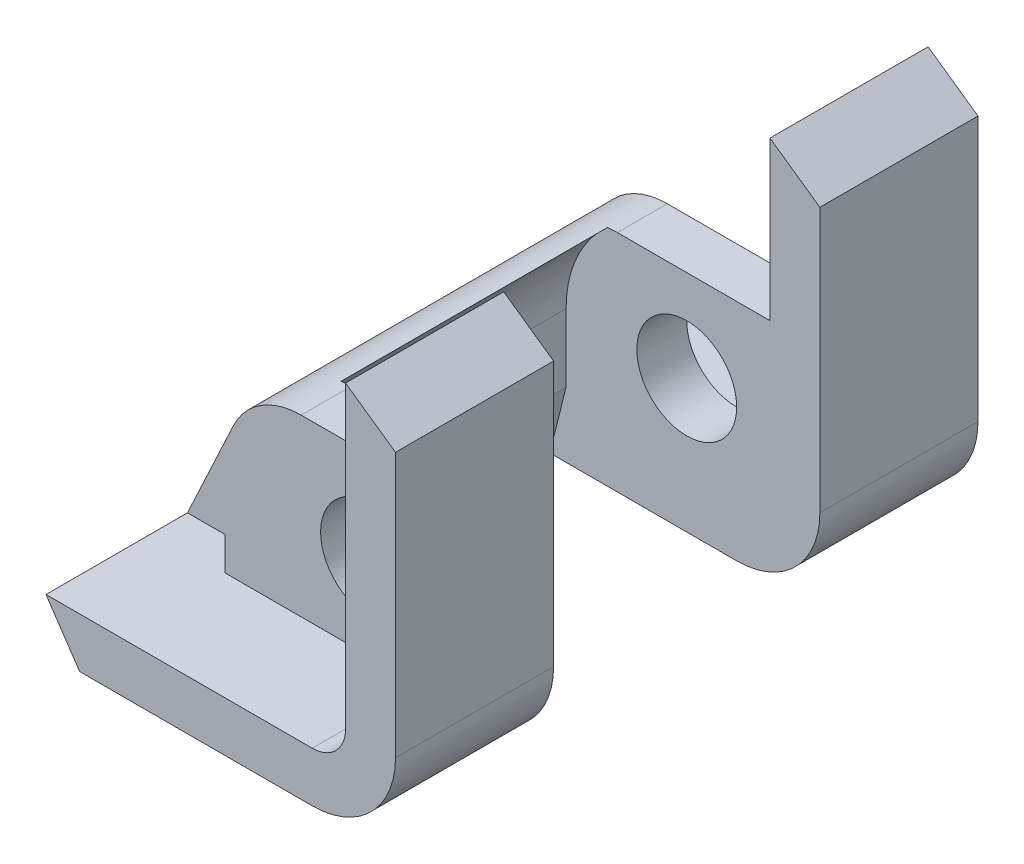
ISO-10303-21;
HEADER;
FILE_DESCRIPTION(('STEP AP214'),'2;1');
FILE_NAME('part.step','',(''),(''),'','','');
FILE_SCHEMA(('AUTOMOTIVE_DESIGN { 1 0 10303 214 1 1 1 1 }'));
ENDSEC;
DATA;
#1=APPLICATION_CONTEXT('core data for automotive mechanical design processes');
#2=APPLICATION_PROTOCOL_DEFINITION('international standard','automotive_design',2000,#1);
#3=PRODUCT_CONTEXT('',#1,'mechanical');
#4=PRODUCT('Part','Part','',(#3));
#5=PRODUCT_RELATED_PRODUCT_CATEGORY('part','',(#4));
#6=PRODUCT_DEFINITION_FORMATION('','',#4);
#7=PRODUCT_DEFINITION_CONTEXT('part definition',#1,'design');
#8=PRODUCT_DEFINITION('design','',#6,#7);
#9=PRODUCT_DEFINITION_SHAPE('','',#8);
#10=(LENGTH_UNIT() NAMED_UNIT(*) SI_UNIT(.MILLI.,.METRE.));
#11=(NAMED_UNIT(*) PLANE_ANGLE_UNIT() SI_UNIT($,.RADIAN.));
#12=(NAMED_UNIT(*) SI_UNIT($,.STERADIAN.) SOLID_ANGLE_UNIT());
#13=UNCERTAINTY_MEASURE_WITH_UNIT(LENGTH_MEASURE(1.E-05),#10,'distance_accuracy_value','');
#14=(GEOMETRIC_REPRESENTATION_CONTEXT(3) GLOBAL_UNCERTAINTY_ASSIGNED_CONTEXT((#13)) GLOBAL_UNIT_ASSIGNED_CONTEXT((#10,
#11,#12)) REPRESENTATION_CONTEXT('',''));
#15=CARTESIAN_POINT('',(0.,0.,0.));
#16=DIRECTION('',(0.,0.,1.));
#17=DIRECTION('',(1.,0.,0.));
#18=AXIS2_PLACEMENT_3D('',#15,#16,#17);
#19=CARTESIAN_POINT('',(-7.623976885,-21.54910891,-11.));
#20=DIRECTION('',(-0.906307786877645,0.422618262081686,0.));
#21=DIRECTION('',(-0.422618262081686,-0.906307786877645,0.));
#22=AXIS2_PLACEMENT_3D('',#19,#20,#21);
#23=PLANE('',#22);
#24=DIRECTION('',(-0.422618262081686,-0.906307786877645,0.));
#25=VECTOR('',#24,1.);
#26=CARTESIAN_POINT('',(-6.24795377,-18.59821782,-11.));
#27=LINE('',#26,#25);
#28=CARTESIAN_POINT('',(-6.24795376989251,-18.5982178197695,-11.));
#29=VERTEX_POINT('',#28);
#30=CARTESIAN_POINT('',(-9.,-24.5,-11.));
#31=VERTEX_POINT('',#30);
#32=EDGE_CURVE('E165',#29,#31,#27,.T.);
#33=ORIENTED_EDGE('',*,*,#32,.T.);
#34=DIRECTION('',(0.,0.,-1.));
#35=VECTOR('',#34,1.);
#36=CARTESIAN_POINT('',(-9.,-24.5,-11.));
#37=LINE('',#36,#35);
#38=CARTESIAN_POINT('',(-9.,-24.5,11.));
#39=VERTEX_POINT('',#38);
#40=EDGE_CURVE('E168',#39,#31,#37,.T.);
#41=ORIENTED_EDGE('',*,*,#40,.F.);
#42=DIRECTION('',(-0.422618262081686,-0.906307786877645,0.));
#43=VECTOR('',#42,1.);
#44=CARTESIAN_POINT('',(-6.24795377,-18.59821782,11.));
#45=LINE('',#44,#43);
#46=CARTESIAN_POINT('',(-6.24795376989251,-18.5982178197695,11.));
#47=VERTEX_POINT('',#46);
#48=EDGE_CURVE('E205',#47,#39,#45,.T.);
#49=ORIENTED_EDGE('',*,*,#48,.F.);
#50=DIRECTION('',(0.,0.,1.));
#51=VECTOR('',#50,1.);
#52=CARTESIAN_POINT('',(-6.24795376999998,-18.59821782,-11.));
#53=LINE('',#52,#51);
#54=EDGE_CURVE('E170',#29,#47,#53,.T.);
#55=ORIENTED_EDGE('',*,*,#54,.F.);
#56=EDGE_LOOP('',(#33,#41,#49,#55));
#57=FACE_BOUND('',#56,.T.);
#58=ADVANCED_FACE('F16',(#57),#23,.T.);
#59=CARTESIAN_POINT('',(-7.875,-24.5,-11.));
#60=DIRECTION('',(0.,-1.,0.));
#61=DIRECTION('',(0.,0.,-1.));
#62=AXIS2_PLACEMENT_3D('',#59,#60,#61);
#63=PLANE('',#62);
#64=DIRECTION('',(1.,0.,0.));
#65=VECTOR('',#64,1.);
#66=CARTESIAN_POINT('',(-0.258475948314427,-24.5,-11.));
#67=LINE('',#66,#65);
#68=CARTESIAN_POINT('',(-6.75,-24.5,-11.));
#69=VERTEX_POINT('',#68);
#70=EDGE_CURVE('E174',#31,#69,#67,.T.);
#71=ORIENTED_EDGE('',*,*,#70,.T.);
#72=DIRECTION('',(0.,0.,1.));
#73=VECTOR('',#72,1.);
#74=CARTESIAN_POINT('',(-6.75,-24.5,-11.));
#75=LINE('',#74,#73);
#76=CARTESIAN_POINT('',(-6.75,-24.5,11.));
#77=VERTEX_POINT('',#76);
#78=EDGE_CURVE('E266',#77,#69,#75,.F.);
#79=ORIENTED_EDGE('',*,*,#78,.F.);
#80=DIRECTION('',(1.,0.,0.));
#81=VECTOR('',#80,1.);
#82=CARTESIAN_POINT('',(-0.258475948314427,-24.5,11.));
#83=LINE('',#82,#81);
#84=EDGE_CURVE('E181',#39,#77,#83,.T.);
#85=ORIENTED_EDGE('',*,*,#84,.F.);
#86=ORIENTED_EDGE('',*,*,#40,.T.);
#87=EDGE_LOOP('',(#71,#79,#85,#86));
#88=FACE_BOUND('',#87,.T.);
#89=ADVANCED_FACE('F178',(#88),#63,.T.);
#90=CARTESIAN_POINT('',(-2.169568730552,-20.4999999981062,-11.));
#91=DIRECTION('',(0.,0.,1.));
#92=DIRECTION('',(1.,0.,0.));
#93=AXIS2_PLACEMENT_3D('',#90,#91,#92);
#94=CYLINDRICAL_SURFACE('',#93,4.49999999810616);
#95=CARTESIAN_POINT('',(-2.169568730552,-20.4999999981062,11.));
#96=DIRECTION('',(0.,0.,1.));
#97=DIRECTION('',(1.,0.,0.));
#98=AXIS2_PLACEMENT_3D('',#95,#96,#97);
#99=CIRCLE('',#98,4.49999999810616);
#100=CARTESIAN_POINT('',(-2.169568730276,-16.,11.));
#101=VERTEX_POINT('',#100);
#102=EDGE_CURVE('E201',#101,#47,#99,.T.);
#103=ORIENTED_EDGE('',*,*,#102,.F.);
#104=DIRECTION('',(0.,0.,1.));
#105=VECTOR('',#104,1.);
#106=CARTESIAN_POINT('',(-2.16956873,-16.,-11.));
#107=LINE('',#106,#105);
#108=CARTESIAN_POINT('',(-2.169568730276,-16.,8.));
#109=VERTEX_POINT('',#108);
#110=EDGE_CURVE('E260',#109,#101,#107,.T.);
#111=ORIENTED_EDGE('',*,*,#110,.F.);
#112=CARTESIAN_POINT('',(-2.169568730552,-20.4999999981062,8.));
#113=DIRECTION('',(0.,0.,1.));
#114=DIRECTION('',(1.,0.,0.));
#115=AXIS2_PLACEMENT_3D('',#112,#113,#114);
#116=CIRCLE('',#115,4.49999999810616);
#117=CARTESIAN_POINT('',(-2.77007343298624,-16.040247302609,8.));
#118=VERTEX_POINT('',#117);
#119=EDGE_CURVE('E19',#109,#118,#116,.T.);
#120=ORIENTED_EDGE('',*,*,#119,.T.);
#121=DIRECTION('',(0.,0.,1.));
#122=VECTOR('',#121,1.);
#123=CARTESIAN_POINT('',(-2.77007343,-16.0402473,-8.));
#124=LINE('',#123,#122);
#125=CARTESIAN_POINT('',(-2.77007343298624,-16.040247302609,-8.));
#126=VERTEX_POINT('',#125);
#127=EDGE_CURVE('E274',#118,#126,#124,.F.);
#128=ORIENTED_EDGE('',*,*,#127,.T.);
#129=CARTESIAN_POINT('',(-2.169568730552,-20.4999999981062,-8.));
#130=DIRECTION('',(0.,0.,1.));
#131=DIRECTION('',(1.,0.,0.));
#132=AXIS2_PLACEMENT_3D('',#129,#130,#131);
#133=CIRCLE('',#132,4.49999999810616);
#134=CARTESIAN_POINT('',(-2.169568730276,-16.,-8.));
#135=VERTEX_POINT('',#134);
#136=EDGE_CURVE('E202',#126,#135,#133,.F.);
#137=ORIENTED_EDGE('',*,*,#136,.T.);
#138=DIRECTION('',(0.,0.,1.));
#139=VECTOR('',#138,1.);
#140=CARTESIAN_POINT('',(-2.16956873,-16.,-11.));
#141=LINE('',#140,#139);
#142=CARTESIAN_POINT('',(-2.169568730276,-16.,-11.));
#143=VERTEX_POINT('',#142);
#144=EDGE_CURVE('E261',#143,#135,#141,.T.);
#145=ORIENTED_EDGE('',*,*,#144,.F.);
#146=CARTESIAN_POINT('',(-2.169568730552,-20.4999999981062,-11.));
#147=DIRECTION('',(0.,0.,1.));
#148=DIRECTION('',(1.,0.,0.));
#149=AXIS2_PLACEMENT_3D('',#146,#147,#148);
#150=CIRCLE('',#149,4.49999999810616);
#151=EDGE_CURVE('E175',#143,#29,#150,.T.);
#152=ORIENTED_EDGE('',*,*,#151,.T.);
#153=ORIENTED_EDGE('',*,*,#54,.T.);
#154=EDGE_LOOP('',(#103,#111,#120,#128,#137,#145,#152,#153));
#155=FACE_BOUND('',#154,.T.);
#156=ADVANCED_FACE('F273',(#155),#94,.T.);
#157=CARTESIAN_POINT('',(-0.258475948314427,-21.5587344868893,11.));
#158=DIRECTION('',(0.,0.,1.));
#159=DIRECTION('',(1.,0.,0.));
#160=AXIS2_PLACEMENT_3D('',#157,#158,#159);
#161=PLANE('',#160);
#162=DIRECTION('',(0.,1.,0.));
#163=VECTOR('',#162,1.);
#164=CARTESIAN_POINT('',(-6.75,-25.5,11.));
#165=LINE('',#164,#163);
#166=CARTESIAN_POINT('',(-6.75,-26.5,11.));
#167=VERTEX_POINT('',#166);
#168=EDGE_CURVE('E204',#167,#77,#165,.T.);
#169=ORIENTED_EDGE('',*,*,#168,.F.);
#170=DIRECTION('',(1.,0.,0.));
#171=VECTOR('',#170,1.);
#172=CARTESIAN_POINT('',(-3.,-26.5,11.));
#173=LINE('',#172,#171);
#174=CARTESIAN_POINT('',(5.,-26.5,11.));
#175=VERTEX_POINT('',#174);
#176=EDGE_CURVE('E251',#175,#167,#173,.F.);
#177=ORIENTED_EDGE('',*,*,#176,.F.);
#178=CARTESIAN_POINT('',(5.,-24.5,11.));
#179=DIRECTION('',(0.,0.,1.));
#180=DIRECTION('',(1.,0.,0.));
#181=AXIS2_PLACEMENT_3D('',#178,#179,#180);
#182=CIRCLE('',#181,2.);
#183=CARTESIAN_POINT('',(7.,-24.5,11.));
#184=VERTEX_POINT('',#183);
#185=EDGE_CURVE('E253',#175,#184,#182,.T.);
#186=ORIENTED_EDGE('',*,*,#185,.T.);
#187=DIRECTION('',(0.,1.,0.));
#188=VECTOR('',#187,1.);
#189=CARTESIAN_POINT('',(7.,-15.5,11.));
#190=LINE('',#189,#188);
#191=CARTESIAN_POINT('',(7.,-16.,11.));
#192=VERTEX_POINT('',#191);
#193=EDGE_CURVE('E386',#192,#184,#190,.F.);
#194=ORIENTED_EDGE('',*,*,#193,.F.);
#195=DIRECTION('',(1.,0.,0.));
#196=VECTOR('',#195,1.);
#197=CARTESIAN_POINT('',(2.415215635,-16.,11.));
#198=LINE('',#197,#196);
#199=EDGE_CURVE('E281',#101,#192,#198,.T.);
#200=ORIENTED_EDGE('',*,*,#199,.F.);
#201=ORIENTED_EDGE('',*,*,#102,.T.);
#202=ORIENTED_EDGE('',*,*,#48,.T.);
#203=ORIENTED_EDGE('',*,*,#84,.T.);
#204=EDGE_LOOP('',(#169,#177,#186,#194,#200,#201,#202,#203));
#205=FACE_BOUND('',#204,.T.);
#206=CARTESIAN_POINT('',(2.,-21.5,11.));
#207=DIRECTION('',(0.,0.,1.));
#208=DIRECTION('',(0.,-1.,0.));
#209=AXIS2_PLACEMENT_3D('',#206,#207,#208);
#210=CIRCLE('',#209,3.);
#211=CARTESIAN_POINT('',(2.,-24.5,11.));
#212=VERTEX_POINT('',#211);
#213=EDGE_CURVE('E257',#212,#212,#210,.F.);
#214=ORIENTED_EDGE('',*,*,#213,.T.);
#215=EDGE_LOOP('',(#214));
#216=FACE_BOUND('',#215,.T.);
#217=ADVANCED_FACE('F460',(#205,#216),#161,.T.);
#218=CARTESIAN_POINT('',(-6.75,-25.5,-11.));
#219=DIRECTION('',(-1.,0.,0.));
#220=DIRECTION('',(0.,0.,1.));
#221=AXIS2_PLACEMENT_3D('',#218,#219,#220);
#222=PLANE('',#221);
#223=DIRECTION('',(0.,1.,0.));
#224=VECTOR('',#223,1.);
#225=CARTESIAN_POINT('',(-6.75,-21.5587344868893,-11.));
#226=LINE('',#225,#224);
#227=CARTESIAN_POINT('',(-6.75,-26.5,-11.));
#228=VERTEX_POINT('',#227);
#229=EDGE_CURVE('E188',#69,#228,#226,.F.);
#230=ORIENTED_EDGE('',*,*,#229,.T.);
#231=DIRECTION('',(0.,0.,1.));
#232=VECTOR('',#231,1.);
#233=CARTESIAN_POINT('',(-6.75,-26.5,-17.5));
#234=LINE('',#233,#232);
#235=EDGE_CURVE('E431',#167,#228,#234,.F.);
#236=ORIENTED_EDGE('',*,*,#235,.F.);
#237=ORIENTED_EDGE('',*,*,#168,.T.);
#238=ORIENTED_EDGE('',*,*,#78,.T.);
#239=EDGE_LOOP('',(#230,#236,#237,#238));
#240=FACE_BOUND('',#239,.T.);
#241=ADVANCED_FACE('F457',(#240),#222,.T.);
#242=CARTESIAN_POINT('',(-0.258475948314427,-21.5587344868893,-11.));
#243=DIRECTION('',(0.,0.,1.));
#244=DIRECTION('',(1.,0.,0.));
#245=AXIS2_PLACEMENT_3D('',#242,#243,#244);
#246=PLANE('',#245);
#247=CARTESIAN_POINT('',(5.,-24.5,-11.));
#248=DIRECTION('',(0.,0.,1.));
#249=DIRECTION('',(1.,0.,0.));
#250=AXIS2_PLACEMENT_3D('',#247,#248,#249);
#251=CIRCLE('',#250,2.);
#252=CARTESIAN_POINT('',(7.,-24.5,-11.));
#253=VERTEX_POINT('',#252);
#254=CARTESIAN_POINT('',(5.,-26.5,-11.));
#255=VERTEX_POINT('',#254);
#256=EDGE_CURVE('E249',#253,#255,#251,.F.);
#257=ORIENTED_EDGE('',*,*,#256,.T.);
#258=DIRECTION('',(1.,0.,0.));
#259=VECTOR('',#258,1.);
#260=CARTESIAN_POINT('',(-3.,-26.5,-11.));
#261=LINE('',#260,#259);
#262=EDGE_CURVE('E369',#228,#255,#261,.T.);
#263=ORIENTED_EDGE('',*,*,#262,.F.);
#264=ORIENTED_EDGE('',*,*,#229,.F.);
#265=ORIENTED_EDGE('',*,*,#70,.F.);
#266=ORIENTED_EDGE('',*,*,#32,.F.);
#267=ORIENTED_EDGE('',*,*,#151,.F.);
#268=DIRECTION('',(1.,0.,0.));
#269=VECTOR('',#268,1.);
#270=CARTESIAN_POINT('',(2.415215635,-16.,-11.));
#271=LINE('',#270,#269);
#272=CARTESIAN_POINT('',(7.,-16.,-11.));
#273=VERTEX_POINT('',#272);
#274=EDGE_CURVE('E264',#273,#143,#271,.F.);
#275=ORIENTED_EDGE('',*,*,#274,.F.);
#276=DIRECTION('',(0.,1.,0.));
#277=VECTOR('',#276,1.);
#278=CARTESIAN_POINT('',(7.,-15.5,-11.));
#279=LINE('',#278,#277);
#280=EDGE_CURVE('E343',#253,#273,#279,.T.);
#281=ORIENTED_EDGE('',*,*,#280,.F.);
#282=EDGE_LOOP('',(#257,#263,#264,#265,#266,#267,#275,#281));
#283=FACE_BOUND('',#282,.T.);
#284=CARTESIAN_POINT('',(2.,-21.5,-11.));
#285=DIRECTION('',(0.,0.,1.));
#286=DIRECTION('',(0.,-1.,0.));
#287=AXIS2_PLACEMENT_3D('',#284,#285,#286);
#288=CIRCLE('',#287,3.);
#289=CARTESIAN_POINT('',(2.,-24.5,-11.));
#290=VERTEX_POINT('',#289);
#291=EDGE_CURVE('E190',#290,#290,#288,.T.);
#292=ORIENTED_EDGE('',*,*,#291,.T.);
#293=EDGE_LOOP('',(#292));
#294=FACE_BOUND('',#293,.T.);
#295=ADVANCED_FACE('F185',(#283,#294),#246,.F.);
#296=CARTESIAN_POINT('',(2.,-21.5,0.));
#297=DIRECTION('',(0.,0.,1.));
#298=DIRECTION('',(0.,-1.,0.));
#299=AXIS2_PLACEMENT_3D('',#296,#297,#298);
#300=CYLINDRICAL_SURFACE('',#299,3.);
#301=ORIENTED_EDGE('',*,*,#291,.F.);
#302=EDGE_LOOP('',(#301));
#303=FACE_BOUND('',#302,.T.);
#304=CARTESIAN_POINT('',(2.,-21.5,-8.));
#305=DIRECTION('',(0.,0.,1.));
#306=DIRECTION('',(0.,-1.,0.));
#307=AXIS2_PLACEMENT_3D('',#304,#305,#306);
#308=CIRCLE('',#307,3.);
#309=CARTESIAN_POINT('',(2.,-24.5,-8.));
#310=VERTEX_POINT('',#309);
#311=EDGE_CURVE('E245',#310,#310,#308,.F.);
#312=ORIENTED_EDGE('',*,*,#311,.F.);
#313=EDGE_LOOP('',(#312));
#314=FACE_BOUND('',#313,.T.);
#315=ADVANCED_FACE('F660',(#303,#314),#300,.F.);
#316=CARTESIAN_POINT('',(2.415215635,-16.,-11.));
#317=DIRECTION('',(0.,1.,0.));
#318=DIRECTION('',(0.,0.,1.));
#319=AXIS2_PLACEMENT_3D('',#316,#317,#318);
#320=PLANE('',#319);
#321=ORIENTED_EDGE('',*,*,#274,.T.);
#322=ORIENTED_EDGE('',*,*,#144,.T.);
#323=DIRECTION('',(1.,0.,0.));
#324=VECTOR('',#323,1.);
#325=CARTESIAN_POINT('',(3.63570820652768,-16.,-8.));
#326=LINE('',#325,#324);
#327=CARTESIAN_POINT('',(7.,-16.,-8.));
#328=VERTEX_POINT('',#327);
#329=EDGE_CURVE('E244',#328,#135,#326,.F.);
#330=ORIENTED_EDGE('',*,*,#329,.F.);
#331=DIRECTION('',(0.,0.,1.));
#332=VECTOR('',#331,1.);
#333=CARTESIAN_POINT('',(7.,-16.,-17.5));
#334=LINE('',#333,#332);
#335=EDGE_CURVE('E358',#273,#328,#334,.T.);
#336=ORIENTED_EDGE('',*,*,#335,.F.);
#337=EDGE_LOOP('',(#321,#322,#330,#336));
#338=FACE_BOUND('',#337,.T.);
#339=ADVANCED_FACE('F469',(#338),#320,.T.);
#340=CARTESIAN_POINT('',(2.,-21.5,0.));
#341=DIRECTION('',(0.,0.,1.));
#342=DIRECTION('',(0.,-1.,0.));
#343=AXIS2_PLACEMENT_3D('',#340,#341,#342);
#344=CYLINDRICAL_SURFACE('',#343,3.);
#345=CARTESIAN_POINT('',(2.,-21.5,8.));
#346=DIRECTION('',(0.,0.,1.));
#347=DIRECTION('',(0.,-1.,0.));
#348=AXIS2_PLACEMENT_3D('',#345,#346,#347);
#349=CIRCLE('',#348,3.);
#350=CARTESIAN_POINT('',(2.,-24.5,8.));
#351=VERTEX_POINT('',#350);
#352=EDGE_CURVE('E236',#351,#351,#349,.F.);
#353=ORIENTED_EDGE('',*,*,#352,.T.);
#354=EDGE_LOOP('',(#353));
#355=FACE_BOUND('',#354,.T.);
#356=ORIENTED_EDGE('',*,*,#213,.F.);
#357=EDGE_LOOP('',(#356));
#358=FACE_BOUND('',#357,.T.);
#359=ADVANCED_FACE('F496',(#355,#358),#344,.F.);
#360=CARTESIAN_POINT('',(2.415215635,-16.,-11.));
#361=DIRECTION('',(0.,1.,0.));
#362=DIRECTION('',(0.,0.,1.));
#363=AXIS2_PLACEMENT_3D('',#360,#361,#362);
#364=PLANE('',#363);
#365=ORIENTED_EDGE('',*,*,#199,.T.);
#366=DIRECTION('',(0.,0.,1.));
#367=VECTOR('',#366,1.);
#368=CARTESIAN_POINT('',(7.,-16.,-17.5));
#369=LINE('',#368,#367);
#370=CARTESIAN_POINT('',(7.,-16.,8.));
#371=VERTEX_POINT('',#370);
#372=EDGE_CURVE('E143',#371,#192,#369,.T.);
#373=ORIENTED_EDGE('',*,*,#372,.F.);
#374=DIRECTION('',(1.,0.,0.));
#375=VECTOR('',#374,1.);
#376=CARTESIAN_POINT('',(3.63570820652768,-16.,8.));
#377=LINE('',#376,#375);
#378=EDGE_CURVE('E235',#371,#109,#377,.F.);
#379=ORIENTED_EDGE('',*,*,#378,.T.);
#380=ORIENTED_EDGE('',*,*,#110,.T.);
#381=EDGE_LOOP('',(#365,#373,#379,#380));
#382=FACE_BOUND('',#381,.T.);
#383=ADVANCED_FACE('F494',(#382),#364,.T.);
#384=CARTESIAN_POINT('',(2.00000002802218,-21.5000000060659,-8.));
#385=DIRECTION('',(0.,0.,1.));
#386=DIRECTION('',(1.,0.,0.));
#387=AXIS2_PLACEMENT_3D('',#384,#385,#386);
#388=CYLINDRICAL_SURFACE('',#387,7.25000002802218);
#389=DIRECTION('',(0.,0.,1.));
#390=VECTOR('',#389,1.);
#391=CARTESIAN_POINT('',(-5.25,-21.5,-8.));
#392=LINE('',#391,#390);
#393=CARTESIAN_POINT('',(-5.25,-21.500000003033,8.));
#394=VERTEX_POINT('',#393);
#395=CARTESIAN_POINT('',(-5.25,-21.500000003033,-8.));
#396=VERTEX_POINT('',#395);
#397=EDGE_CURVE('E280',#394,#396,#392,.F.);
#398=ORIENTED_EDGE('',*,*,#397,.T.);
#399=CARTESIAN_POINT('',(2.00000002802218,-21.5000000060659,-8.));
#400=DIRECTION('',(0.,0.,1.));
#401=DIRECTION('',(1.,0.,0.));
#402=AXIS2_PLACEMENT_3D('',#399,#400,#401);
#403=CIRCLE('',#402,7.25000002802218);
#404=EDGE_CURVE('E240',#126,#396,#403,.T.);
#405=ORIENTED_EDGE('',*,*,#404,.F.);
#406=ORIENTED_EDGE('',*,*,#127,.F.);
#407=CARTESIAN_POINT('',(2.00000002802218,-21.5000000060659,8.));
#408=DIRECTION('',(0.,0.,1.));
#409=DIRECTION('',(1.,0.,0.));
#410=AXIS2_PLACEMENT_3D('',#407,#408,#409);
#411=CIRCLE('',#410,7.25000002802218);
#412=EDGE_CURVE('E232',#118,#394,#411,.T.);
#413=ORIENTED_EDGE('',*,*,#412,.T.);
#414=EDGE_LOOP('',(#398,#405,#406,#413));
#415=FACE_BOUND('',#414,.T.);
#416=ADVANCED_FACE('F278',(#415),#388,.F.);
#417=CARTESIAN_POINT('',(-5.25,-23.54178745,-8.));
#418=DIRECTION('',(-1.,0.,0.));
#419=DIRECTION('',(0.,0.,1.));
#420=AXIS2_PLACEMENT_3D('',#417,#418,#419);
#421=PLANE('',#420);
#422=DIRECTION('',(0.,0.,1.));
#423=VECTOR('',#422,1.);
#424=CARTESIAN_POINT('',(-5.25,-25.5835749,-8.));
#425=LINE('',#424,#423);
#426=CARTESIAN_POINT('',(-5.25,-25.5835749,8.));
#427=VERTEX_POINT('',#426);
#428=CARTESIAN_POINT('',(-5.25,-25.5835749,-8.));
#429=VERTEX_POINT('',#428);
#430=EDGE_CURVE('E317',#427,#429,#425,.F.);
#431=ORIENTED_EDGE('',*,*,#430,.T.);
#432=DIRECTION('',(0.,1.,0.));
#433=VECTOR('',#432,1.);
#434=CARTESIAN_POINT('',(-5.25,-19.7247353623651,-8.));
#435=LINE('',#434,#433);
#436=EDGE_CURVE('E243',#396,#429,#435,.F.);
#437=ORIENTED_EDGE('',*,*,#436,.F.);
#438=ORIENTED_EDGE('',*,*,#397,.F.);
#439=DIRECTION('',(0.,1.,0.));
#440=VECTOR('',#439,1.);
#441=CARTESIAN_POINT('',(-5.25,-19.7247353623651,8.));
#442=LINE('',#441,#440);
#443=EDGE_CURVE('E234',#394,#427,#442,.F.);
#444=ORIENTED_EDGE('',*,*,#443,.T.);
#445=EDGE_LOOP('',(#431,#437,#438,#444));
#446=FACE_BOUND('',#445,.T.);
#447=ADVANCED_FACE('F503',(#446),#421,.F.);
#448=CARTESIAN_POINT('',(8.5,-7.550311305,-17.5));
#449=DIRECTION('',(0.573576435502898,0.819152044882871,0.));
#450=DIRECTION('',(-0.819152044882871,0.573576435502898,0.));
#451=AXIS2_PLACEMENT_3D('',#448,#449,#450);
#452=PLANE('',#451);
#453=DIRECTION('',(-0.819152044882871,0.573576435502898,0.));
#454=VECTOR('',#453,1.);
#455=CARTESIAN_POINT('',(10.,-8.60062261,17.5));
#456=LINE('',#455,#454);
#457=CARTESIAN_POINT('',(10.,-8.60062261,17.5));
#458=VERTEX_POINT('',#457);
#459=CARTESIAN_POINT('',(7.,-6.5,17.5));
#460=VERTEX_POINT('',#459);
#461=EDGE_CURVE('E374',#458,#460,#456,.T.);
#462=ORIENTED_EDGE('',*,*,#461,.F.);
#463=DIRECTION('',(0.,0.,-1.));
#464=VECTOR('',#463,1.);
#465=CARTESIAN_POINT('',(10.,-8.60062261,-17.5));
#466=LINE('',#465,#464);
#467=CARTESIAN_POINT('',(10.,-8.60062261,8.));
#468=VERTEX_POINT('',#467);
#469=EDGE_CURVE('E252',#468,#458,#466,.F.);
#470=ORIENTED_EDGE('',*,*,#469,.F.);
#471=DIRECTION('',(-0.819152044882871,0.573576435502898,0.));
#472=VECTOR('',#471,1.);
#473=CARTESIAN_POINT('',(10.,-8.60062261,8.));
#474=LINE('',#473,#472);
#475=CARTESIAN_POINT('',(7.,-6.5,8.));
#476=VERTEX_POINT('',#475);
#477=EDGE_CURVE('E389',#468,#476,#474,.T.);
#478=ORIENTED_EDGE('',*,*,#477,.T.);
#479=DIRECTION('',(0.,0.,1.));
#480=VECTOR('',#479,1.);
#481=CARTESIAN_POINT('',(7.,-6.5,-17.5));
#482=LINE('',#481,#480);
#483=EDGE_CURVE('E383',#460,#476,#482,.F.);
#484=ORIENTED_EDGE('',*,*,#483,.F.);
#485=EDGE_LOOP('',(#462,#470,#478,#484));
#486=FACE_BOUND('',#485,.T.);
#487=ADVANCED_FACE('F566',(#486),#452,.T.);
#488=CARTESIAN_POINT('',(7.,-15.5,-17.5));
#489=DIRECTION('',(-1.,0.,0.));
#490=DIRECTION('',(0.,0.,1.));
#491=AXIS2_PLACEMENT_3D('',#488,#489,#490);
#492=PLANE('',#491);
#493=DIRECTION('',(0.,1.,0.));
#494=VECTOR('',#493,1.);
#495=CARTESIAN_POINT('',(7.,-21.9736869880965,17.5));
#496=LINE('',#495,#494);
#497=CARTESIAN_POINT('',(7.,-24.5,17.5));
#498=VERTEX_POINT('',#497);
#499=EDGE_CURVE('E226',#460,#498,#496,.F.);
#500=ORIENTED_EDGE('',*,*,#499,.F.);
#501=ORIENTED_EDGE('',*,*,#483,.T.);
#502=DIRECTION('',(0.,1.,0.));
#503=VECTOR('',#502,1.);
#504=CARTESIAN_POINT('',(7.,-19.7247353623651,8.));
#505=LINE('',#504,#503);
#506=EDGE_CURVE('E231',#476,#371,#505,.F.);
#507=ORIENTED_EDGE('',*,*,#506,.T.);
#508=ORIENTED_EDGE('',*,*,#372,.T.);
#509=ORIENTED_EDGE('',*,*,#193,.T.);
#510=DIRECTION('',(0.,0.,1.));
#511=VECTOR('',#510,1.);
#512=CARTESIAN_POINT('',(7.,-24.5,-17.5));
#513=LINE('',#512,#511);
#514=EDGE_CURVE('E256',#184,#498,#513,.T.);
#515=ORIENTED_EDGE('',*,*,#514,.T.);
#516=EDGE_LOOP('',(#500,#501,#507,#508,#509,#515));
#517=FACE_BOUND('',#516,.T.);
#518=ADVANCED_FACE('F491',(#517),#492,.T.);
#519=CARTESIAN_POINT('',(5.,-24.5,-17.5));
#520=DIRECTION('',(0.,0.,1.));
#521=DIRECTION('',(1.,0.,0.));
#522=AXIS2_PLACEMENT_3D('',#519,#520,#521);
#523=CYLINDRICAL_SURFACE('',#522,2.);
#524=DIRECTION('',(0.,0.,1.));
#525=VECTOR('',#524,1.);
#526=CARTESIAN_POINT('',(5.,-26.5,-17.5));
#527=LINE('',#526,#525);
#528=CARTESIAN_POINT('',(5.,-26.5,17.5));
#529=VERTEX_POINT('',#528);
#530=EDGE_CURVE('E347',#529,#175,#527,.F.);
#531=ORIENTED_EDGE('',*,*,#530,.F.);
#532=CARTESIAN_POINT('',(5.,-24.5,17.5));
#533=DIRECTION('',(0.,0.,1.));
#534=DIRECTION('',(1.,0.,0.));
#535=AXIS2_PLACEMENT_3D('',#532,#533,#534);
#536=CIRCLE('',#535,2.);
#537=EDGE_CURVE('E223',#498,#529,#536,.F.);
#538=ORIENTED_EDGE('',*,*,#537,.F.);
#539=ORIENTED_EDGE('',*,*,#514,.F.);
#540=ORIENTED_EDGE('',*,*,#185,.F.);
#541=EDGE_LOOP('',(#531,#538,#539,#540));
#542=FACE_BOUND('',#541,.T.);
#543=ADVANCED_FACE('F486',(#542),#523,.F.);
#544=CARTESIAN_POINT('',(10.,-16.550311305,-17.5));
#545=DIRECTION('',(1.,0.,0.));
#546=DIRECTION('',(0.,0.,-1.));
#547=AXIS2_PLACEMENT_3D('',#544,#545,#546);
#548=PLANE('',#547);
#549=DIRECTION('',(0.,1.,0.));
#550=VECTOR('',#549,1.);
#551=CARTESIAN_POINT('',(10.,-21.9736869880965,17.5));
#552=LINE('',#551,#550);
#553=CARTESIAN_POINT('',(10.,-24.5,17.5));
#554=VERTEX_POINT('',#553);
#555=EDGE_CURVE('E221',#554,#458,#552,.T.);
#556=ORIENTED_EDGE('',*,*,#555,.F.);
#557=DIRECTION('',(0.,0.,1.));
#558=VECTOR('',#557,1.);
#559=CARTESIAN_POINT('',(10.,-24.5,-17.5));
#560=LINE('',#559,#558);
#561=CARTESIAN_POINT('',(10.,-24.5,8.));
#562=VERTEX_POINT('',#561);
#563=EDGE_CURVE('E230',#562,#554,#560,.T.);
#564=ORIENTED_EDGE('',*,*,#563,.F.);
#565=DIRECTION('',(0.,1.,0.));
#566=VECTOR('',#565,1.);
#567=CARTESIAN_POINT('',(10.,-19.7247353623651,8.));
#568=LINE('',#567,#566);
#569=EDGE_CURVE('E295',#562,#468,#568,.T.);
#570=ORIENTED_EDGE('',*,*,#569,.T.);
#571=ORIENTED_EDGE('',*,*,#469,.T.);
#572=EDGE_LOOP('',(#556,#564,#570,#571));
#573=FACE_BOUND('',#572,.T.);
#574=ADVANCED_FACE('F558',(#573),#548,.T.);
#575=CARTESIAN_POINT('',(5.,-24.5,-17.5));
#576=DIRECTION('',(0.,0.,1.));
#577=DIRECTION('',(1.,0.,0.));
#578=AXIS2_PLACEMENT_3D('',#575,#576,#577);
#579=CYLINDRICAL_SURFACE('',#578,2.);
#580=DIRECTION('',(0.,0.,1.));
#581=VECTOR('',#580,1.);
#582=CARTESIAN_POINT('',(7.,-24.5,-17.5));
#583=LINE('',#582,#581);
#584=CARTESIAN_POINT('',(7.,-24.5,-17.5));
#585=VERTEX_POINT('',#584);
#586=EDGE_CURVE('E340',#585,#253,#583,.T.);
#587=ORIENTED_EDGE('',*,*,#586,.F.);
#588=CARTESIAN_POINT('',(5.,-24.5,-17.5));
#589=DIRECTION('',(0.,0.,1.));
#590=DIRECTION('',(1.,0.,0.));
#591=AXIS2_PLACEMENT_3D('',#588,#589,#590);
#592=CIRCLE('',#591,2.);
#593=CARTESIAN_POINT('',(5.,-26.5,-17.5));
#594=VERTEX_POINT('',#593);
#595=EDGE_CURVE('E214',#585,#594,#592,.F.);
#596=ORIENTED_EDGE('',*,*,#595,.T.);
#597=DIRECTION('',(0.,0.,1.));
#598=VECTOR('',#597,1.);
#599=CARTESIAN_POINT('',(5.,-26.5,-17.5));
#600=LINE('',#599,#598);
#601=EDGE_CURVE('E366',#255,#594,#600,.F.);
#602=ORIENTED_EDGE('',*,*,#601,.F.);
#603=ORIENTED_EDGE('',*,*,#256,.F.);
#604=EDGE_LOOP('',(#587,#596,#602,#603));
#605=FACE_BOUND('',#604,.T.);
#606=ADVANCED_FACE('F477',(#605),#579,.F.);
#607=CARTESIAN_POINT('',(-3.,-26.5,-17.5));
#608=DIRECTION('',(0.,1.,0.));
#609=DIRECTION('',(0.,0.,1.));
#610=AXIS2_PLACEMENT_3D('',#607,#608,#609);
#611=PLANE('',#610);
#612=DIRECTION('',(1.,0.,0.));
#613=VECTOR('',#612,1.);
#614=CARTESIAN_POINT('',(3.50018825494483,-26.5,17.5));
#615=LINE('',#614,#613);
#616=CARTESIAN_POINT('',(-11.,-26.5,17.5));
#617=VERTEX_POINT('',#616);
#618=EDGE_CURVE('E222',#529,#617,#615,.F.);
#619=ORIENTED_EDGE('',*,*,#618,.F.);
#620=ORIENTED_EDGE('',*,*,#530,.T.);
#621=ORIENTED_EDGE('',*,*,#176,.T.);
#622=ORIENTED_EDGE('',*,*,#235,.T.);
#623=ORIENTED_EDGE('',*,*,#262,.T.);
#624=ORIENTED_EDGE('',*,*,#601,.T.);
#625=DIRECTION('',(1.,0.,0.));
#626=VECTOR('',#625,1.);
#627=CARTESIAN_POINT('',(3.50018825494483,-26.5,-17.5));
#628=LINE('',#627,#626);
#629=CARTESIAN_POINT('',(-11.,-26.5,-17.5));
#630=VERTEX_POINT('',#629);
#631=EDGE_CURVE('E216',#594,#630,#628,.F.);
#632=ORIENTED_EDGE('',*,*,#631,.T.);
#633=DIRECTION('',(0.,0.,1.));
#634=VECTOR('',#633,1.);
#635=CARTESIAN_POINT('',(-11.,-26.5,-17.5));
#636=LINE('',#635,#634);
#637=EDGE_CURVE('E217',#617,#630,#636,.F.);
#638=ORIENTED_EDGE('',*,*,#637,.F.);
#639=EDGE_LOOP('',(#619,#620,#621,#622,#623,#624,#632,#638));
#640=FACE_BOUND('',#639,.T.);
#641=ADVANCED_FACE('F481',(#640),#611,.T.);
#642=CARTESIAN_POINT('',(8.5,-7.550311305,-17.5));
#643=DIRECTION('',(0.573576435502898,0.819152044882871,0.));
#644=DIRECTION('',(-0.819152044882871,0.573576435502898,0.));
#645=AXIS2_PLACEMENT_3D('',#642,#643,#644);
#646=PLANE('',#645);
#647=DIRECTION('',(-0.819152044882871,0.573576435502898,0.));
#648=VECTOR('',#647,1.);
#649=CARTESIAN_POINT('',(10.,-8.60062261,-17.5));
#650=LINE('',#649,#648);
#651=CARTESIAN_POINT('',(10.,-8.60062261,-17.5));
#652=VERTEX_POINT('',#651);
#653=CARTESIAN_POINT('',(7.,-6.5,-17.5));
#654=VERTEX_POINT('',#653);
#655=EDGE_CURVE('E350',#652,#654,#650,.T.);
#656=ORIENTED_EDGE('',*,*,#655,.T.);
#657=DIRECTION('',(0.,0.,1.));
#658=VECTOR('',#657,1.);
#659=CARTESIAN_POINT('',(7.,-6.5,-17.5));
#660=LINE('',#659,#658);
#661=CARTESIAN_POINT('',(7.,-6.5,-8.));
#662=VERTEX_POINT('',#661);
#663=EDGE_CURVE('E344',#662,#654,#660,.F.);
#664=ORIENTED_EDGE('',*,*,#663,.F.);
#665=DIRECTION('',(-0.819152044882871,0.573576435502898,0.));
#666=VECTOR('',#665,1.);
#667=CARTESIAN_POINT('',(10.,-8.60062261,-8.));
#668=LINE('',#667,#666);
#669=CARTESIAN_POINT('',(10.,-8.60062261,-8.));
#670=VERTEX_POINT('',#669);
#671=EDGE_CURVE('E327',#670,#662,#668,.T.);
#672=ORIENTED_EDGE('',*,*,#671,.F.);
#673=DIRECTION('',(0.,0.,-1.));
#674=VECTOR('',#673,1.);
#675=CARTESIAN_POINT('',(10.,-8.60062261,-17.5));
#676=LINE('',#675,#674);
#677=EDGE_CURVE('E248',#652,#670,#676,.F.);
#678=ORIENTED_EDGE('',*,*,#677,.F.);
#679=EDGE_LOOP('',(#656,#664,#672,#678));
#680=FACE_BOUND('',#679,.T.);
#681=ADVANCED_FACE('F550',(#680),#646,.T.);
#682=CARTESIAN_POINT('',(7.,-15.5,-17.5));
#683=DIRECTION('',(-1.,0.,0.));
#684=DIRECTION('',(0.,0.,1.));
#685=AXIS2_PLACEMENT_3D('',#682,#683,#684);
#686=PLANE('',#685);
#687=ORIENTED_EDGE('',*,*,#280,.T.);
#688=ORIENTED_EDGE('',*,*,#335,.T.);
#689=DIRECTION('',(0.,1.,0.));
#690=VECTOR('',#689,1.);
#691=CARTESIAN_POINT('',(7.,-19.7247353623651,-8.));
#692=LINE('',#691,#690);
#693=EDGE_CURVE('E395',#662,#328,#692,.F.);
#694=ORIENTED_EDGE('',*,*,#693,.F.);
#695=ORIENTED_EDGE('',*,*,#663,.T.);
#696=DIRECTION('',(0.,1.,0.));
#697=VECTOR('',#696,1.);
#698=CARTESIAN_POINT('',(7.,-21.9736869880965,-17.5));
#699=LINE('',#698,#697);
#700=EDGE_CURVE('E213',#654,#585,#699,.F.);
#701=ORIENTED_EDGE('',*,*,#700,.T.);
#702=ORIENTED_EDGE('',*,*,#586,.T.);
#703=EDGE_LOOP('',(#687,#688,#694,#695,#701,#702));
#704=FACE_BOUND('',#703,.T.);
#705=ADVANCED_FACE('F472',(#704),#686,.T.);
#706=CARTESIAN_POINT('',(10.,-16.550311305,-17.5));
#707=DIRECTION('',(1.,0.,0.));
#708=DIRECTION('',(0.,0.,-1.));
#709=AXIS2_PLACEMENT_3D('',#706,#707,#708);
#710=PLANE('',#709);
#711=DIRECTION('',(0.,1.,0.));
#712=VECTOR('',#711,1.);
#713=CARTESIAN_POINT('',(10.,-21.9736869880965,-17.5));
#714=LINE('',#713,#712);
#715=CARTESIAN_POINT('',(10.,-24.5,-17.5));
#716=VERTEX_POINT('',#715);
#717=EDGE_CURVE('E353',#716,#652,#714,.T.);
#718=ORIENTED_EDGE('',*,*,#717,.T.);
#719=ORIENTED_EDGE('',*,*,#677,.T.);
#720=DIRECTION('',(0.,1.,0.));
#721=VECTOR('',#720,1.);
#722=CARTESIAN_POINT('',(10.,-19.7247353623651,-8.));
#723=LINE('',#722,#721);
#724=CARTESIAN_POINT('',(10.,-24.5,-8.));
#725=VERTEX_POINT('',#724);
#726=EDGE_CURVE('E324',#725,#670,#723,.T.);
#727=ORIENTED_EDGE('',*,*,#726,.F.);
#728=DIRECTION('',(0.,0.,1.));
#729=VECTOR('',#728,1.);
#730=CARTESIAN_POINT('',(10.,-24.5,-17.5));
#731=LINE('',#730,#729);
#732=EDGE_CURVE('E209',#716,#725,#731,.T.);
#733=ORIENTED_EDGE('',*,*,#732,.F.);
#734=EDGE_LOOP('',(#718,#719,#727,#733));
#735=FACE_BOUND('',#734,.T.);
#736=ADVANCED_FACE('F543',(#735),#710,.T.);
#737=CARTESIAN_POINT('',(3.63570820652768,-19.7247353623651,-8.));
#738=DIRECTION('',(0.,0.,1.));
#739=DIRECTION('',(1.,0.,0.));
#740=AXIS2_PLACEMENT_3D('',#737,#738,#739);
#741=PLANE('',#740);
#742=ORIENTED_EDGE('',*,*,#671,.T.);
#743=ORIENTED_EDGE('',*,*,#693,.T.);
#744=ORIENTED_EDGE('',*,*,#329,.T.);
#745=ORIENTED_EDGE('',*,*,#136,.F.);
#746=ORIENTED_EDGE('',*,*,#404,.T.);
#747=ORIENTED_EDGE('',*,*,#436,.T.);
#748=DIRECTION('',(-0.24192189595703,-0.970295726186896,0.));
#749=VECTOR('',#748,1.);
#750=CARTESIAN_POINT('',(-5.738237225,-27.54178745,-8.));
#751=LINE('',#750,#749);
#752=CARTESIAN_POINT('',(-6.22647445,-29.5,-8.));
#753=VERTEX_POINT('',#752);
#754=EDGE_CURVE('E239',#429,#753,#751,.T.);
#755=ORIENTED_EDGE('',*,*,#754,.T.);
#756=DIRECTION('',(1.,0.,0.));
#757=VECTOR('',#756,1.);
#758=CARTESIAN_POINT('',(-1.988237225,-29.5,-8.));
#759=LINE('',#758,#757);
#760=CARTESIAN_POINT('',(5.,-29.5,-8.));
#761=VERTEX_POINT('',#760);
#762=EDGE_CURVE('E312',#761,#753,#759,.F.);
#763=ORIENTED_EDGE('',*,*,#762,.F.);
#764=CARTESIAN_POINT('',(5.,-24.5,-8.));
#765=DIRECTION('',(0.,0.,1.));
#766=DIRECTION('',(1.,0.,0.));
#767=AXIS2_PLACEMENT_3D('',#764,#765,#766);
#768=CIRCLE('',#767,5.);
#769=EDGE_CURVE('E210',#725,#761,#768,.F.);
#770=ORIENTED_EDGE('',*,*,#769,.F.);
#771=ORIENTED_EDGE('',*,*,#726,.T.);
#772=EDGE_LOOP('',(#742,#743,#744,#745,#746,#747,#755,#763,#770,#771));
#773=FACE_BOUND('',#772,.T.);
#774=ORIENTED_EDGE('',*,*,#311,.T.);
#775=EDGE_LOOP('',(#774));
#776=FACE_BOUND('',#775,.T.);
#777=ADVANCED_FACE('F539',(#773,#776),#741,.T.);
#778=CARTESIAN_POINT('',(-5.738237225,-27.54178745,-8.));
#779=DIRECTION('',(-0.970295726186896,0.24192189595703,0.));
#780=DIRECTION('',(-0.24192189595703,-0.970295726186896,0.));
#781=AXIS2_PLACEMENT_3D('',#778,#779,#780);
#782=PLANE('',#781);
#783=DIRECTION('',(0.,0.,-1.));
#784=VECTOR('',#783,1.);
#785=CARTESIAN_POINT('',(-6.22647445,-29.5,-17.5));
#786=LINE('',#785,#784);
#787=CARTESIAN_POINT('',(-6.22647445,-29.5,8.));
#788=VERTEX_POINT('',#787);
#789=EDGE_CURVE('E308',#753,#788,#786,.F.);
#790=ORIENTED_EDGE('',*,*,#789,.F.);
#791=ORIENTED_EDGE('',*,*,#754,.F.);
#792=ORIENTED_EDGE('',*,*,#430,.F.);
#793=DIRECTION('',(-0.24192189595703,-0.970295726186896,0.));
#794=VECTOR('',#793,1.);
#795=CARTESIAN_POINT('',(-5.25,-25.5835749,8.));
#796=LINE('',#795,#794);
#797=EDGE_CURVE('E291',#427,#788,#796,.T.);
#798=ORIENTED_EDGE('',*,*,#797,.T.);
#799=EDGE_LOOP('',(#790,#791,#792,#798));
#800=FACE_BOUND('',#799,.T.);
#801=ADVANCED_FACE('F536',(#800),#782,.F.);
#802=CARTESIAN_POINT('',(3.63570820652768,-19.7247353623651,8.));
#803=DIRECTION('',(0.,0.,1.));
#804=DIRECTION('',(1.,0.,0.));
#805=AXIS2_PLACEMENT_3D('',#802,#803,#804);
#806=PLANE('',#805);
#807=ORIENTED_EDGE('',*,*,#477,.F.);
#808=ORIENTED_EDGE('',*,*,#569,.F.);
#809=CARTESIAN_POINT('',(5.,-24.5,8.));
#810=DIRECTION('',(0.,0.,1.));
#811=DIRECTION('',(1.,0.,0.));
#812=AXIS2_PLACEMENT_3D('',#809,#810,#811);
#813=CIRCLE('',#812,5.);
#814=CARTESIAN_POINT('',(5.,-29.5,8.));
#815=VERTEX_POINT('',#814);
#816=EDGE_CURVE('E227',#815,#562,#813,.T.);
#817=ORIENTED_EDGE('',*,*,#816,.F.);
#818=DIRECTION('',(1.,0.,0.));
#819=VECTOR('',#818,1.);
#820=CARTESIAN_POINT('',(-1.988237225,-29.5,8.));
#821=LINE('',#820,#819);
#822=EDGE_CURVE('E311',#788,#815,#821,.T.);
#823=ORIENTED_EDGE('',*,*,#822,.F.);
#824=ORIENTED_EDGE('',*,*,#797,.F.);
#825=ORIENTED_EDGE('',*,*,#443,.F.);
#826=ORIENTED_EDGE('',*,*,#412,.F.);
#827=ORIENTED_EDGE('',*,*,#119,.F.);
#828=ORIENTED_EDGE('',*,*,#378,.F.);
#829=ORIENTED_EDGE('',*,*,#506,.F.);
#830=EDGE_LOOP('',(#807,#808,#817,#823,#824,#825,#826,#827,#828,#829));
#831=FACE_BOUND('',#830,.T.);
#832=ORIENTED_EDGE('',*,*,#352,.F.);
#833=EDGE_LOOP('',(#832));
#834=FACE_BOUND('',#833,.T.);
#835=ADVANCED_FACE('F285',(#831,#834),#806,.F.);
#836=CARTESIAN_POINT('',(5.,-24.5,-17.5));
#837=DIRECTION('',(0.,0.,1.));
#838=DIRECTION('',(1.,0.,0.));
#839=AXIS2_PLACEMENT_3D('',#836,#837,#838);
#840=CYLINDRICAL_SURFACE('',#839,5.);
#841=CARTESIAN_POINT('',(5.,-24.5,17.5));
#842=DIRECTION('',(0.,0.,1.));
#843=DIRECTION('',(1.,0.,0.));
#844=AXIS2_PLACEMENT_3D('',#841,#842,#843);
#845=CIRCLE('',#844,5.);
#846=CARTESIAN_POINT('',(5.,-29.5,17.5));
#847=VERTEX_POINT('',#846);
#848=EDGE_CURVE('E218',#847,#554,#845,.T.);
#849=ORIENTED_EDGE('',*,*,#848,.F.);
#850=DIRECTION('',(0.,0.,-1.));
#851=VECTOR('',#850,1.);
#852=CARTESIAN_POINT('',(5.,-29.5,-17.5));
#853=LINE('',#852,#851);
#854=EDGE_CURVE('E604',#815,#847,#853,.F.);
#855=ORIENTED_EDGE('',*,*,#854,.F.);
#856=ORIENTED_EDGE('',*,*,#816,.T.);
#857=ORIENTED_EDGE('',*,*,#563,.T.);
#858=EDGE_LOOP('',(#849,#855,#856,#857));
#859=FACE_BOUND('',#858,.T.);
#860=ADVANCED_FACE('F529',(#859),#840,.T.);
#861=CARTESIAN_POINT('',(3.50018825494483,-21.9736869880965,17.5));
#862=DIRECTION('',(0.,0.,1.));
#863=DIRECTION('',(1.,0.,0.));
#864=AXIS2_PLACEMENT_3D('',#861,#862,#863);
#865=PLANE('',#864);
#866=ORIENTED_EDGE('',*,*,#848,.T.);
#867=ORIENTED_EDGE('',*,*,#555,.T.);
#868=ORIENTED_EDGE('',*,*,#461,.T.);
#869=ORIENTED_EDGE('',*,*,#499,.T.);
#870=ORIENTED_EDGE('',*,*,#537,.T.);
#871=ORIENTED_EDGE('',*,*,#618,.T.);
#872=DIRECTION('',(0.559192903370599,-0.829037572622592,0.));
#873=VECTOR('',#872,1.);
#874=CARTESIAN_POINT('',(-9.988237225,-28.,17.5));
#875=LINE('',#874,#873);
#876=CARTESIAN_POINT('',(-8.97647445,-29.5,17.5));
#877=VERTEX_POINT('',#876);
#878=EDGE_CURVE('E363',#877,#617,#875,.F.);
#879=ORIENTED_EDGE('',*,*,#878,.F.);
#880=DIRECTION('',(1.,0.,0.));
#881=VECTOR('',#880,1.);
#882=CARTESIAN_POINT('',(-1.988237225,-29.5,17.5));
#883=LINE('',#882,#881);
#884=EDGE_CURVE('E607',#847,#877,#883,.F.);
#885=ORIENTED_EDGE('',*,*,#884,.F.);
#886=EDGE_LOOP('',(#866,#867,#868,#869,#870,#871,#879,#885));
#887=FACE_BOUND('',#886,.T.);
#888=ADVANCED_FACE('F525',(#887),#865,.T.);
#889=CARTESIAN_POINT('',(-9.988237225,-28.,-17.5));
#890=DIRECTION('',(-0.829037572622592,-0.559192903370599,0.));
#891=DIRECTION('',(0.559192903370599,-0.829037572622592,0.));
#892=AXIS2_PLACEMENT_3D('',#889,#890,#891);
#893=PLANE('',#892);
#894=DIRECTION('',(0.559192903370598,-0.829037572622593,0.));
#895=VECTOR('',#894,1.);
#896=CARTESIAN_POINT('',(-11.,-26.5,-17.5));
#897=LINE('',#896,#895);
#898=CARTESIAN_POINT('',(-8.97647445,-29.5,-17.5));
#899=VERTEX_POINT('',#898);
#900=EDGE_CURVE('E636',#630,#899,#897,.T.);
#901=ORIENTED_EDGE('',*,*,#900,.T.);
#902=DIRECTION('',(0.,0.,-1.));
#903=VECTOR('',#902,1.);
#904=CARTESIAN_POINT('',(-8.97647445,-29.5,-17.5));
#905=LINE('',#904,#903);
#906=EDGE_CURVE('E625',#877,#899,#905,.T.);
#907=ORIENTED_EDGE('',*,*,#906,.F.);
#908=ORIENTED_EDGE('',*,*,#878,.T.);
#909=ORIENTED_EDGE('',*,*,#637,.T.);
#910=EDGE_LOOP('',(#901,#907,#908,#909));
#911=FACE_BOUND('',#910,.T.);
#912=ADVANCED_FACE('F522',(#911),#893,.T.);
#913=CARTESIAN_POINT('',(3.50018825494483,-21.9736869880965,-17.5));
#914=DIRECTION('',(0.,0.,1.));
#915=DIRECTION('',(1.,0.,0.));
#916=AXIS2_PLACEMENT_3D('',#913,#914,#915);
#917=PLANE('',#916);
#918=ORIENTED_EDGE('',*,*,#655,.F.);
#919=ORIENTED_EDGE('',*,*,#717,.F.);
#920=CARTESIAN_POINT('',(5.,-24.5,-17.5));
#921=DIRECTION('',(0.,0.,1.));
#922=DIRECTION('',(1.,0.,0.));
#923=AXIS2_PLACEMENT_3D('',#920,#921,#922);
#924=CIRCLE('',#923,5.);
#925=CARTESIAN_POINT('',(5.,-29.5,-17.5));
#926=VERTEX_POINT('',#925);
#927=EDGE_CURVE('E34',#926,#716,#924,.T.);
#928=ORIENTED_EDGE('',*,*,#927,.F.);
#929=DIRECTION('',(1.,0.,0.));
#930=VECTOR('',#929,1.);
#931=CARTESIAN_POINT('',(-1.988237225,-29.5,-17.5));
#932=LINE('',#931,#930);
#933=EDGE_CURVE('E25',#899,#926,#932,.T.);
#934=ORIENTED_EDGE('',*,*,#933,.F.);
#935=ORIENTED_EDGE('',*,*,#900,.F.);
#936=ORIENTED_EDGE('',*,*,#631,.F.);
#937=ORIENTED_EDGE('',*,*,#595,.F.);
#938=ORIENTED_EDGE('',*,*,#700,.F.);
#939=EDGE_LOOP('',(#918,#919,#928,#934,#935,#936,#937,#938));
#940=FACE_BOUND('',#939,.T.);
#941=ADVANCED_FACE('F515',(#940),#917,.F.);
#942=CARTESIAN_POINT('',(5.,-24.5,-17.5));
#943=DIRECTION('',(0.,0.,1.));
#944=DIRECTION('',(1.,0.,0.));
#945=AXIS2_PLACEMENT_3D('',#942,#943,#944);
#946=CYLINDRICAL_SURFACE('',#945,5.);
#947=ORIENTED_EDGE('',*,*,#927,.T.);
#948=ORIENTED_EDGE('',*,*,#732,.T.);
#949=ORIENTED_EDGE('',*,*,#769,.T.);
#950=DIRECTION('',(0.,0.,-1.));
#951=VECTOR('',#950,1.);
#952=CARTESIAN_POINT('',(5.,-29.5,-17.5));
#953=LINE('',#952,#951);
#954=EDGE_CURVE('E11',#926,#761,#953,.F.);
#955=ORIENTED_EDGE('',*,*,#954,.F.);
#956=EDGE_LOOP('',(#947,#948,#949,#955));
#957=FACE_BOUND('',#956,.T.);
#958=ADVANCED_FACE('F509',(#957),#946,.T.);
#959=CARTESIAN_POINT('',(-1.988237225,-29.5,-17.5));
#960=DIRECTION('',(0.,-1.,0.));
#961=DIRECTION('',(0.,0.,-1.));
#962=AXIS2_PLACEMENT_3D('',#959,#960,#961);
#963=PLANE('',#962);
#964=ORIENTED_EDGE('',*,*,#933,.T.);
#965=ORIENTED_EDGE('',*,*,#954,.T.);
#966=ORIENTED_EDGE('',*,*,#762,.T.);
#967=ORIENTED_EDGE('',*,*,#789,.T.);
#968=ORIENTED_EDGE('',*,*,#822,.T.);
#969=ORIENTED_EDGE('',*,*,#854,.T.);
#970=ORIENTED_EDGE('',*,*,#884,.T.);
#971=ORIENTED_EDGE('',*,*,#906,.T.);
#972=EDGE_LOOP('',(#964,#965,#966,#967,#968,#969,#970,#971));
#973=FACE_BOUND('',#972,.T.);
#974=ADVANCED_FACE('F507',(#973),#963,.T.);
#975=CLOSED_SHELL('',(#58,#89,#156,#217,#241,#295,#315,#339,#359,#383,#416,#447,#487,#518,#543,
#574,#606,#641,#681,#705,#736,#777,#801,#835,#860,#888,#912,#941,#958,#974));
#976=MANIFOLD_SOLID_BREP('B1',#975);
#977=ADVANCED_BREP_SHAPE_REPRESENTATION('',(#18,#976),#14);
#978=SHAPE_DEFINITION_REPRESENTATION(#9,#977);
ENDSEC;
END-ISO-10303-21;
